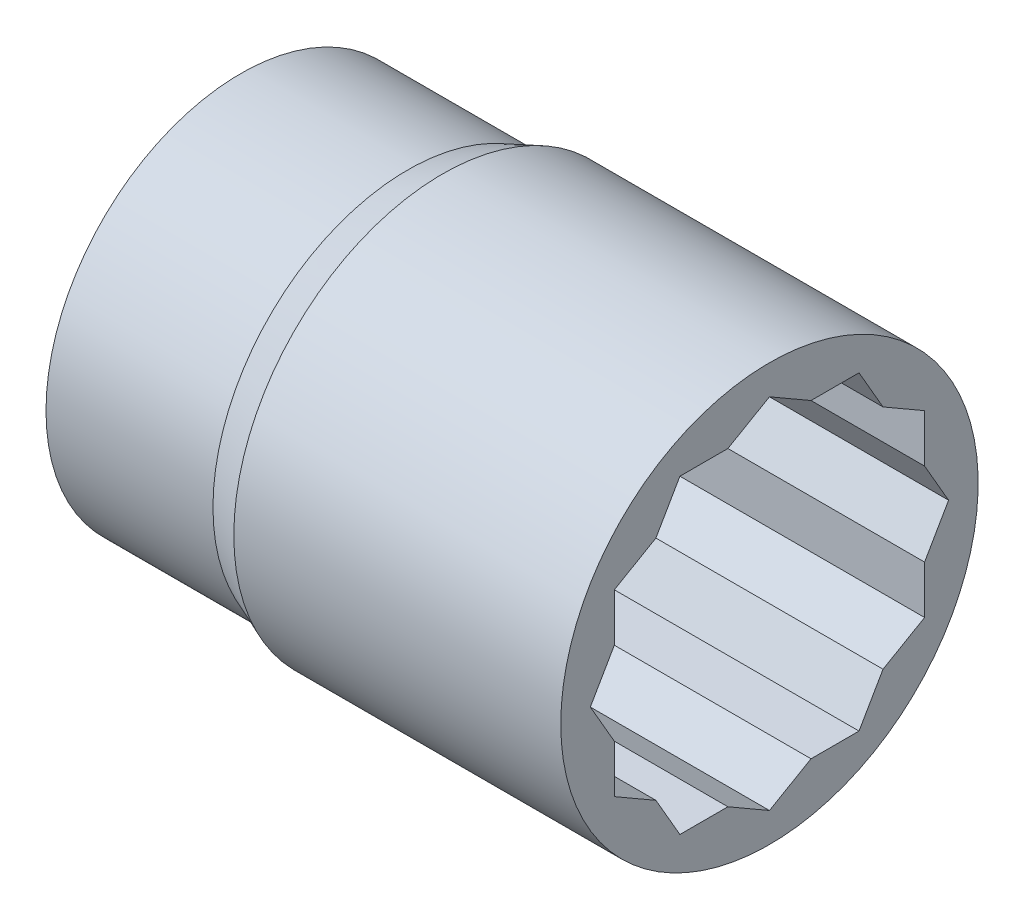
ISO-10303-21;
HEADER;
FILE_DESCRIPTION(('STEP AP214'),'2;1');
FILE_NAME('part.step','',(''),(''),'','','');
FILE_SCHEMA(('AUTOMOTIVE_DESIGN { 1 0 10303 214 1 1 1 1 }'));
ENDSEC;
DATA;
#1=APPLICATION_CONTEXT('core data for automotive mechanical design processes');
#2=APPLICATION_PROTOCOL_DEFINITION('international standard','automotive_design',2000,#1);
#3=PRODUCT_CONTEXT('',#1,'mechanical');
#4=PRODUCT('Part','Part','',(#3));
#5=PRODUCT_RELATED_PRODUCT_CATEGORY('part','',(#4));
#6=PRODUCT_DEFINITION_FORMATION('','',#4);
#7=PRODUCT_DEFINITION_CONTEXT('part definition',#1,'design');
#8=PRODUCT_DEFINITION('design','',#6,#7);
#9=PRODUCT_DEFINITION_SHAPE('','',#8);
#10=(LENGTH_UNIT() NAMED_UNIT(*) SI_UNIT(.MILLI.,.METRE.));
#11=(NAMED_UNIT(*) PLANE_ANGLE_UNIT() SI_UNIT($,.RADIAN.));
#12=(NAMED_UNIT(*) SI_UNIT($,.STERADIAN.) SOLID_ANGLE_UNIT());
#13=UNCERTAINTY_MEASURE_WITH_UNIT(LENGTH_MEASURE(1.E-05),#10,'distance_accuracy_value','');
#14=(GEOMETRIC_REPRESENTATION_CONTEXT(3) GLOBAL_UNCERTAINTY_ASSIGNED_CONTEXT((#13)) GLOBAL_UNIT_ASSIGNED_CONTEXT((#10,
#11,#12)) REPRESENTATION_CONTEXT('',''));
#15=CARTESIAN_POINT('',(0.,0.,0.));
#16=DIRECTION('',(0.,0.,1.));
#17=DIRECTION('',(1.,0.,0.));
#18=AXIS2_PLACEMENT_3D('',#15,#16,#17);
#19=CARTESIAN_POINT('',(38.,15.,0.));
#20=DIRECTION('',(-1.,0.,0.));
#21=DIRECTION('',(0.,0.,1.));
#22=AXIS2_PLACEMENT_3D('',#19,#20,#21);
#23=PLANE('',#22);
#24=DIRECTION('',(0.,-0.499999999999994,-0.866025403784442));
#25=VECTOR('',#24,1.);
#26=CARTESIAN_POINT('',(38.,-6.43745550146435,11.15));
#27=LINE('',#26,#25);
#28=CARTESIAN_POINT('',(38.,-6.43745550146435,11.15));
#29=VERTEX_POINT('',#28);
#30=CARTESIAN_POINT('',(38.,-8.16236650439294,8.16236650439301));
#31=VERTEX_POINT('',#30);
#32=EDGE_CURVE('E230',#29,#31,#27,.T.);
#33=ORIENTED_EDGE('',*,*,#32,.F.);
#34=DIRECTION('',(0.,-1.,0.));
#35=VECTOR('',#34,1.);
#36=CARTESIAN_POINT('',(38.,-2.98763349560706,11.15));
#37=LINE('',#36,#35);
#38=CARTESIAN_POINT('',(38.,-2.98763349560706,11.15));
#39=VERTEX_POINT('',#38);
#40=EDGE_CURVE('E46',#39,#29,#37,.T.);
#41=ORIENTED_EDGE('',*,*,#40,.F.);
#42=DIRECTION('',(0.,-0.866025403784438,-0.5));
#43=VECTOR('',#42,1.);
#44=CARTESIAN_POINT('',(38.,0.,12.8749110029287));
#45=LINE('',#44,#43);
#46=CARTESIAN_POINT('',(38.,0.,12.8749110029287));
#47=VERTEX_POINT('',#46);
#48=EDGE_CURVE('E299',#47,#39,#45,.T.);
#49=ORIENTED_EDGE('',*,*,#48,.F.);
#50=DIRECTION('',(0.,-0.866025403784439,0.5));
#51=VECTOR('',#50,1.);
#52=CARTESIAN_POINT('',(38.,2.98763349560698,11.15));
#53=LINE('',#52,#51);
#54=CARTESIAN_POINT('',(38.,2.98763349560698,11.15));
#55=VERTEX_POINT('',#54);
#56=EDGE_CURVE('E296',#55,#47,#53,.T.);
#57=ORIENTED_EDGE('',*,*,#56,.F.);
#58=DIRECTION('',(0.,-1.,0.));
#59=VECTOR('',#58,1.);
#60=CARTESIAN_POINT('',(38.,6.43745550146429,11.15));
#61=LINE('',#60,#59);
#62=CARTESIAN_POINT('',(38.,6.43745550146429,11.15));
#63=VERTEX_POINT('',#62);
#64=EDGE_CURVE('E293',#63,#55,#61,.T.);
#65=ORIENTED_EDGE('',*,*,#64,.F.);
#66=DIRECTION('',(0.,-0.500000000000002,0.866025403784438));
#67=VECTOR('',#66,1.);
#68=CARTESIAN_POINT('',(38.,8.16236650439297,8.16236650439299));
#69=LINE('',#68,#67);
#70=CARTESIAN_POINT('',(38.,8.16236650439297,8.16236650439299));
#71=VERTEX_POINT('',#70);
#72=EDGE_CURVE('E290',#71,#63,#69,.T.);
#73=ORIENTED_EDGE('',*,*,#72,.F.);
#74=DIRECTION('',(0.,-0.866025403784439,0.5));
#75=VECTOR('',#74,1.);
#76=CARTESIAN_POINT('',(38.,11.15,6.43745550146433));
#77=LINE('',#76,#75);
#78=CARTESIAN_POINT('',(38.,11.15,6.43745550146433));
#79=VERTEX_POINT('',#78);
#80=EDGE_CURVE('E287',#79,#71,#77,.T.);
#81=ORIENTED_EDGE('',*,*,#80,.F.);
#82=DIRECTION('',(0.,0.,1.));
#83=VECTOR('',#82,1.);
#84=CARTESIAN_POINT('',(38.,11.15,2.98763349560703));
#85=LINE('',#84,#83);
#86=CARTESIAN_POINT('',(38.,11.15,2.98763349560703));
#87=VERTEX_POINT('',#86);
#88=EDGE_CURVE('E284',#87,#79,#85,.T.);
#89=ORIENTED_EDGE('',*,*,#88,.F.);
#90=DIRECTION('',(0.,-0.500000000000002,0.866025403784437));
#91=VECTOR('',#90,1.);
#92=CARTESIAN_POINT('',(38.,12.8749110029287,0.));
#93=LINE('',#92,#91);
#94=CARTESIAN_POINT('',(38.,12.8749110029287,0.));
#95=VERTEX_POINT('',#94);
#96=EDGE_CURVE('E281',#95,#87,#93,.T.);
#97=ORIENTED_EDGE('',*,*,#96,.F.);
#98=DIRECTION('',(0.,0.5,0.866025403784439));
#99=VECTOR('',#98,1.);
#100=CARTESIAN_POINT('',(38.,11.15,-2.98763349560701));
#101=LINE('',#100,#99);
#102=CARTESIAN_POINT('',(38.,11.15,-2.98763349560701));
#103=VERTEX_POINT('',#102);
#104=EDGE_CURVE('E278',#103,#95,#101,.T.);
#105=ORIENTED_EDGE('',*,*,#104,.F.);
#106=DIRECTION('',(0.,0.,1.));
#107=VECTOR('',#106,1.);
#108=CARTESIAN_POINT('',(38.,11.15,-6.43745550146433));
#109=LINE('',#108,#107);
#110=CARTESIAN_POINT('',(38.,11.15,-6.43745550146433));
#111=VERTEX_POINT('',#110);
#112=EDGE_CURVE('E275',#111,#103,#109,.T.);
#113=ORIENTED_EDGE('',*,*,#112,.F.);
#114=DIRECTION('',(0.,0.866025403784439,0.5));
#115=VECTOR('',#114,1.);
#116=CARTESIAN_POINT('',(38.,8.16236650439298,-8.16236650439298));
#117=LINE('',#116,#115);
#118=CARTESIAN_POINT('',(38.,8.16236650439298,-8.16236650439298));
#119=VERTEX_POINT('',#118);
#120=EDGE_CURVE('E272',#119,#111,#117,.T.);
#121=ORIENTED_EDGE('',*,*,#120,.F.);
#122=DIRECTION('',(0.,0.499999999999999,0.866025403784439));
#123=VECTOR('',#122,1.);
#124=CARTESIAN_POINT('',(38.,6.43745550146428,-11.1500000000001));
#125=LINE('',#124,#123);
#126=CARTESIAN_POINT('',(38.,6.43745550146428,-11.1500000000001));
#127=VERTEX_POINT('',#126);
#128=EDGE_CURVE('E269',#127,#119,#125,.T.);
#129=ORIENTED_EDGE('',*,*,#128,.F.);
#130=DIRECTION('',(0.,1.,0.));
#131=VECTOR('',#130,1.);
#132=CARTESIAN_POINT('',(38.,2.98763349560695,-11.15));
#133=LINE('',#132,#131);
#134=CARTESIAN_POINT('',(38.,2.98763349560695,-11.15));
#135=VERTEX_POINT('',#134);
#136=EDGE_CURVE('E266',#135,#127,#133,.T.);
#137=ORIENTED_EDGE('',*,*,#136,.F.);
#138=DIRECTION('',(0.,0.866025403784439,0.5));
#139=VECTOR('',#138,1.);
#140=CARTESIAN_POINT('',(38.,0.,-12.8749110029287));
#141=LINE('',#140,#139);
#142=CARTESIAN_POINT('',(38.,0.,-12.8749110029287));
#143=VERTEX_POINT('',#142);
#144=EDGE_CURVE('E263',#143,#135,#141,.T.);
#145=ORIENTED_EDGE('',*,*,#144,.F.);
#146=DIRECTION('',(0.,0.866025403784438,-0.5));
#147=VECTOR('',#146,1.);
#148=CARTESIAN_POINT('',(38.,-2.98763349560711,-11.1499999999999));
#149=LINE('',#148,#147);
#150=CARTESIAN_POINT('',(38.,-2.98763349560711,-11.1499999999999));
#151=VERTEX_POINT('',#150);
#152=EDGE_CURVE('E260',#151,#143,#149,.T.);
#153=ORIENTED_EDGE('',*,*,#152,.F.);
#154=DIRECTION('',(0.,1.,0.));
#155=VECTOR('',#154,1.);
#156=CARTESIAN_POINT('',(38.,-6.43745550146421,-11.1499999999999));
#157=LINE('',#156,#155);
#158=CARTESIAN_POINT('',(38.,-6.43745550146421,-11.1499999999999));
#159=VERTEX_POINT('',#158);
#160=EDGE_CURVE('E257',#159,#151,#157,.T.);
#161=ORIENTED_EDGE('',*,*,#160,.F.);
#162=DIRECTION('',(0.,0.500000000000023,-0.866025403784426));
#163=VECTOR('',#162,1.);
#164=CARTESIAN_POINT('',(38.,-8.16236650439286,-8.16236650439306));
#165=LINE('',#164,#163);
#166=CARTESIAN_POINT('',(38.,-8.16236650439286,-8.16236650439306));
#167=VERTEX_POINT('',#166);
#168=EDGE_CURVE('E254',#167,#159,#165,.T.);
#169=ORIENTED_EDGE('',*,*,#168,.F.);
#170=DIRECTION('',(0.,0.866025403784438,-0.500000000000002));
#171=VECTOR('',#170,1.);
#172=CARTESIAN_POINT('',(38.,-11.15,-6.43745550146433));
#173=LINE('',#172,#171);
#174=CARTESIAN_POINT('',(38.,-11.15,-6.43745550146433));
#175=VERTEX_POINT('',#174);
#176=EDGE_CURVE('E251',#175,#167,#173,.T.);
#177=ORIENTED_EDGE('',*,*,#176,.F.);
#178=DIRECTION('',(0.,0.,-1.));
#179=VECTOR('',#178,1.);
#180=CARTESIAN_POINT('',(38.,-11.15,-2.98763349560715));
#181=LINE('',#180,#179);
#182=CARTESIAN_POINT('',(38.,-11.15,-2.98763349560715));
#183=VERTEX_POINT('',#182);
#184=EDGE_CURVE('E248',#183,#175,#181,.T.);
#185=ORIENTED_EDGE('',*,*,#184,.F.);
#186=DIRECTION('',(0.,0.500000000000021,-0.866025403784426));
#187=VECTOR('',#186,1.);
#188=CARTESIAN_POINT('',(38.,-12.8749110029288,-1.29366534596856E-13));
#189=LINE('',#188,#187);
#190=CARTESIAN_POINT('',(38.,-12.8749110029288,-1.29366534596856E-13));
#191=VERTEX_POINT('',#190);
#192=EDGE_CURVE('E245',#191,#183,#189,.T.);
#193=ORIENTED_EDGE('',*,*,#192,.F.);
#194=DIRECTION('',(0.,-0.500000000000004,-0.866025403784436));
#195=VECTOR('',#194,1.);
#196=CARTESIAN_POINT('',(38.,-11.15,2.98763349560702));
#197=LINE('',#196,#195);
#198=CARTESIAN_POINT('',(38.,-11.15,2.98763349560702));
#199=VERTEX_POINT('',#198);
#200=EDGE_CURVE('E239',#199,#191,#197,.T.);
#201=ORIENTED_EDGE('',*,*,#200,.F.);
#202=DIRECTION('',(0.,0.,-1.));
#203=VECTOR('',#202,1.);
#204=CARTESIAN_POINT('',(38.,-11.15,6.43745550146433));
#205=LINE('',#204,#203);
#206=CARTESIAN_POINT('',(38.,-11.15,6.43745550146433));
#207=VERTEX_POINT('',#206);
#208=EDGE_CURVE('E237',#207,#199,#205,.T.);
#209=ORIENTED_EDGE('',*,*,#208,.F.);
#210=DIRECTION('',(0.,-0.866025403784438,-0.5));
#211=VECTOR('',#210,1.);
#212=CARTESIAN_POINT('',(38.,-8.16236650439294,8.16236650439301));
#213=LINE('',#212,#211);
#214=EDGE_CURVE('E219',#31,#207,#213,.T.);
#215=ORIENTED_EDGE('',*,*,#214,.F.);
#216=EDGE_LOOP('',(#33,#41,#49,#57,#65,#73,#81,#89,#97,#105,#113,#121,#129,#137,#145,#153,#161,
#169,#177,#185,#193,#201,#209,#215));
#217=FACE_BOUND('',#216,.T.);
#218=CARTESIAN_POINT('',(38.,0.,0.));
#219=DIRECTION('',(-1.,0.,0.));
#220=DIRECTION('',(0.,0.,1.));
#221=AXIS2_PLACEMENT_3D('',#218,#219,#220);
#222=CIRCLE('',#221,15.);
#223=CARTESIAN_POINT('',(38.,0.,15.));
#224=VERTEX_POINT('',#223);
#225=EDGE_CURVE('E39',#224,#224,#222,.T.);
#226=ORIENTED_EDGE('',*,*,#225,.F.);
#227=EDGE_LOOP('',(#226));
#228=FACE_BOUND('',#227,.T.);
#229=ADVANCED_FACE('F32',(#217,#228),#23,.F.);
#230=CARTESIAN_POINT('',(0.,0.,0.));
#231=DIRECTION('',(-1.,0.,0.));
#232=DIRECTION('',(0.,0.,1.));
#233=AXIS2_PLACEMENT_3D('',#230,#231,#232);
#234=CYLINDRICAL_SURFACE('',#233,15.);
#235=CARTESIAN_POINT('',(14.5,0.,0.));
#236=DIRECTION('',(-1.,0.,0.));
#237=DIRECTION('',(0.,0.,1.));
#238=AXIS2_PLACEMENT_3D('',#235,#236,#237);
#239=CIRCLE('',#238,15.);
#240=CARTESIAN_POINT('',(14.5,0.,15.));
#241=VERTEX_POINT('',#240);
#242=EDGE_CURVE('E448',#241,#241,#239,.T.);
#243=ORIENTED_EDGE('',*,*,#242,.F.);
#244=EDGE_LOOP('',(#243));
#245=FACE_BOUND('',#244,.T.);
#246=ORIENTED_EDGE('',*,*,#225,.T.);
#247=EDGE_LOOP('',(#246));
#248=FACE_BOUND('',#247,.T.);
#249=ADVANCED_FACE('F453',(#245,#248),#234,.T.);
#250=CARTESIAN_POINT('',(14.5,0.,0.));
#251=DIRECTION('',(1.,0.,0.));
#252=DIRECTION('',(0.,0.,-1.));
#253=AXIS2_PLACEMENT_3D('',#250,#251,#252);
#254=CONICAL_SURFACE('',#253,15.,0.380506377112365);
#255=CARTESIAN_POINT('',(12.,0.,0.));
#256=DIRECTION('',(-1.,0.,0.));
#257=DIRECTION('',(0.,0.,1.));
#258=AXIS2_PLACEMENT_3D('',#255,#256,#257);
#259=CIRCLE('',#258,14.);
#260=CARTESIAN_POINT('',(12.,0.,14.));
#261=VERTEX_POINT('',#260);
#262=EDGE_CURVE('E445',#261,#261,#259,.T.);
#263=ORIENTED_EDGE('',*,*,#262,.F.);
#264=EDGE_LOOP('',(#263));
#265=FACE_BOUND('',#264,.T.);
#266=ORIENTED_EDGE('',*,*,#242,.T.);
#267=EDGE_LOOP('',(#266));
#268=FACE_BOUND('',#267,.T.);
#269=ADVANCED_FACE('F458',(#265,#268),#254,.T.);
#270=CARTESIAN_POINT('',(0.,0.,0.));
#271=DIRECTION('',(-1.,0.,0.));
#272=DIRECTION('',(0.,0.,1.));
#273=AXIS2_PLACEMENT_3D('',#270,#271,#272);
#274=CYLINDRICAL_SURFACE('',#273,14.);
#275=CARTESIAN_POINT('',(0.,0.,0.));
#276=DIRECTION('',(-1.,0.,0.));
#277=DIRECTION('',(0.,0.,1.));
#278=AXIS2_PLACEMENT_3D('',#275,#276,#277);
#279=CIRCLE('',#278,14.);
#280=CARTESIAN_POINT('',(0.,0.,14.));
#281=VERTEX_POINT('',#280);
#282=EDGE_CURVE('E437',#281,#281,#279,.T.);
#283=ORIENTED_EDGE('',*,*,#282,.F.);
#284=EDGE_LOOP('',(#283));
#285=FACE_BOUND('',#284,.T.);
#286=ORIENTED_EDGE('',*,*,#262,.T.);
#287=EDGE_LOOP('',(#286));
#288=FACE_BOUND('',#287,.T.);
#289=ADVANCED_FACE('F463',(#285,#288),#274,.T.);
#290=CARTESIAN_POINT('',(0.,0.,0.));
#291=DIRECTION('',(1.,0.,0.));
#292=DIRECTION('',(0.,0.,-1.));
#293=AXIS2_PLACEMENT_3D('',#290,#291,#292);
#294=PLANE('',#293);
#295=DIRECTION('',(0.,0.,1.));
#296=VECTOR('',#295,1.);
#297=CARTESIAN_POINT('',(0.,-6.,-6.));
#298=LINE('',#297,#296);
#299=CARTESIAN_POINT('',(0.,-6.,-6.));
#300=VERTEX_POINT('',#299);
#301=CARTESIAN_POINT('',(0.,-6.,6.));
#302=VERTEX_POINT('',#301);
#303=EDGE_CURVE('E425',#300,#302,#298,.T.);
#304=ORIENTED_EDGE('',*,*,#303,.F.);
#305=DIRECTION('',(0.,-1.,0.));
#306=VECTOR('',#305,1.);
#307=CARTESIAN_POINT('',(0.,6.,-6.));
#308=LINE('',#307,#306);
#309=CARTESIAN_POINT('',(0.,6.,-6.));
#310=VERTEX_POINT('',#309);
#311=EDGE_CURVE('E422',#310,#300,#308,.T.);
#312=ORIENTED_EDGE('',*,*,#311,.F.);
#313=DIRECTION('',(0.,0.,-1.));
#314=VECTOR('',#313,1.);
#315=CARTESIAN_POINT('',(0.,6.,-6.));
#316=LINE('',#315,#314);
#317=CARTESIAN_POINT('',(0.,6.,6.));
#318=VERTEX_POINT('',#317);
#319=EDGE_CURVE('E431',#318,#310,#316,.T.);
#320=ORIENTED_EDGE('',*,*,#319,.F.);
#321=DIRECTION('',(0.,1.,0.));
#322=VECTOR('',#321,1.);
#323=CARTESIAN_POINT('',(0.,6.,6.));
#324=LINE('',#323,#322);
#325=EDGE_CURVE('E428',#302,#318,#324,.T.);
#326=ORIENTED_EDGE('',*,*,#325,.F.);
#327=EDGE_LOOP('',(#304,#312,#320,#326));
#328=FACE_BOUND('',#327,.T.);
#329=ORIENTED_EDGE('',*,*,#282,.T.);
#330=EDGE_LOOP('',(#329));
#331=FACE_BOUND('',#330,.T.);
#332=ADVANCED_FACE('F470',(#328,#331),#294,.F.);
#333=CARTESIAN_POINT('',(38.,6.,-6.));
#334=DIRECTION('',(0.,0.,-1.));
#335=DIRECTION('',(0.,1.,0.));
#336=AXIS2_PLACEMENT_3D('',#333,#334,#335);
#337=PLANE('',#336);
#338=DIRECTION('',(-1.,0.,0.));
#339=VECTOR('',#338,1.);
#340=CARTESIAN_POINT('',(38.,-6.,-6.));
#341=LINE('',#340,#339);
#342=CARTESIAN_POINT('',(18.,-6.,-6.));
#343=VERTEX_POINT('',#342);
#344=EDGE_CURVE('E434',#343,#300,#341,.T.);
#345=ORIENTED_EDGE('',*,*,#344,.F.);
#346=DIRECTION('',(0.,1.,0.));
#347=VECTOR('',#346,1.);
#348=CARTESIAN_POINT('',(18.,6.,-6.));
#349=LINE('',#348,#347);
#350=CARTESIAN_POINT('',(18.,6.,-6.));
#351=VERTEX_POINT('',#350);
#352=EDGE_CURVE('E54',#343,#351,#349,.T.);
#353=ORIENTED_EDGE('',*,*,#352,.T.);
#354=DIRECTION('',(-1.,0.,0.));
#355=VECTOR('',#354,1.);
#356=CARTESIAN_POINT('',(38.,6.,-6.));
#357=LINE('',#356,#355);
#358=EDGE_CURVE('E435',#351,#310,#357,.T.);
#359=ORIENTED_EDGE('',*,*,#358,.T.);
#360=ORIENTED_EDGE('',*,*,#311,.T.);
#361=EDGE_LOOP('',(#345,#353,#359,#360));
#362=FACE_BOUND('',#361,.T.);
#363=ADVANCED_FACE('F474',(#362),#337,.F.);
#364=CARTESIAN_POINT('',(38.,6.,-6.));
#365=DIRECTION('',(0.,1.,0.));
#366=DIRECTION('',(0.,0.,1.));
#367=AXIS2_PLACEMENT_3D('',#364,#365,#366);
#368=PLANE('',#367);
#369=ORIENTED_EDGE('',*,*,#358,.F.);
#370=DIRECTION('',(0.,0.,1.));
#371=VECTOR('',#370,1.);
#372=CARTESIAN_POINT('',(18.,6.,-6.));
#373=LINE('',#372,#371);
#374=CARTESIAN_POINT('',(18.,6.,6.));
#375=VERTEX_POINT('',#374);
#376=EDGE_CURVE('E418',#351,#375,#373,.T.);
#377=ORIENTED_EDGE('',*,*,#376,.T.);
#378=DIRECTION('',(-1.,0.,0.));
#379=VECTOR('',#378,1.);
#380=CARTESIAN_POINT('',(38.,6.,6.));
#381=LINE('',#380,#379);
#382=EDGE_CURVE('E438',#375,#318,#381,.T.);
#383=ORIENTED_EDGE('',*,*,#382,.T.);
#384=ORIENTED_EDGE('',*,*,#319,.T.);
#385=EDGE_LOOP('',(#369,#377,#383,#384));
#386=FACE_BOUND('',#385,.T.);
#387=ADVANCED_FACE('F478',(#386),#368,.F.);
#388=CARTESIAN_POINT('',(38.,6.,6.));
#389=DIRECTION('',(0.,0.,1.));
#390=DIRECTION('',(0.,-1.,0.));
#391=AXIS2_PLACEMENT_3D('',#388,#389,#390);
#392=PLANE('',#391);
#393=ORIENTED_EDGE('',*,*,#382,.F.);
#394=DIRECTION('',(0.,-1.,0.));
#395=VECTOR('',#394,1.);
#396=CARTESIAN_POINT('',(18.,6.,6.));
#397=LINE('',#396,#395);
#398=CARTESIAN_POINT('',(18.,-6.,6.));
#399=VERTEX_POINT('',#398);
#400=EDGE_CURVE('E373',#375,#399,#397,.T.);
#401=ORIENTED_EDGE('',*,*,#400,.T.);
#402=DIRECTION('',(-1.,0.,0.));
#403=VECTOR('',#402,1.);
#404=CARTESIAN_POINT('',(38.,-6.,6.));
#405=LINE('',#404,#403);
#406=EDGE_CURVE('E440',#399,#302,#405,.T.);
#407=ORIENTED_EDGE('',*,*,#406,.T.);
#408=ORIENTED_EDGE('',*,*,#325,.T.);
#409=EDGE_LOOP('',(#393,#401,#407,#408));
#410=FACE_BOUND('',#409,.T.);
#411=ADVANCED_FACE('F484',(#410),#392,.F.);
#412=CARTESIAN_POINT('',(38.,-6.,-6.));
#413=DIRECTION('',(0.,-1.,0.));
#414=DIRECTION('',(0.,0.,-1.));
#415=AXIS2_PLACEMENT_3D('',#412,#413,#414);
#416=PLANE('',#415);
#417=ORIENTED_EDGE('',*,*,#406,.F.);
#418=DIRECTION('',(0.,0.,-1.));
#419=VECTOR('',#418,1.);
#420=CARTESIAN_POINT('',(18.,-6.,-6.));
#421=LINE('',#420,#419);
#422=EDGE_CURVE('E11',#399,#343,#421,.T.);
#423=ORIENTED_EDGE('',*,*,#422,.T.);
#424=ORIENTED_EDGE('',*,*,#344,.T.);
#425=ORIENTED_EDGE('',*,*,#303,.T.);
#426=EDGE_LOOP('',(#417,#423,#424,#425));
#427=FACE_BOUND('',#426,.T.);
#428=ADVANCED_FACE('F480',(#427),#416,.F.);
#429=CARTESIAN_POINT('',(18.,11.15,11.1500000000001));
#430=DIRECTION('',(-1.,0.,0.));
#431=DIRECTION('',(0.,0.,1.));
#432=AXIS2_PLACEMENT_3D('',#429,#430,#431);
#433=PLANE('',#432);
#434=DIRECTION('',(0.,-1.,0.));
#435=VECTOR('',#434,1.);
#436=CARTESIAN_POINT('',(18.,-2.98763349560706,11.15));
#437=LINE('',#436,#435);
#438=CARTESIAN_POINT('',(18.,-2.98763349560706,11.15));
#439=VERTEX_POINT('',#438);
#440=CARTESIAN_POINT('',(18.,-6.43745550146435,11.15));
#441=VERTEX_POINT('',#440);
#442=EDGE_CURVE('E302',#439,#441,#437,.T.);
#443=ORIENTED_EDGE('',*,*,#442,.T.);
#444=DIRECTION('',(0.,-0.499999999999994,-0.866025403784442));
#445=VECTOR('',#444,1.);
#446=CARTESIAN_POINT('',(18.,-6.43745550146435,11.15));
#447=LINE('',#446,#445);
#448=CARTESIAN_POINT('',(18.,-8.16236650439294,8.16236650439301));
#449=VERTEX_POINT('',#448);
#450=EDGE_CURVE('E305',#441,#449,#447,.T.);
#451=ORIENTED_EDGE('',*,*,#450,.T.);
#452=DIRECTION('',(0.,-0.866025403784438,-0.5));
#453=VECTOR('',#452,1.);
#454=CARTESIAN_POINT('',(18.,-8.16236650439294,8.16236650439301));
#455=LINE('',#454,#453);
#456=CARTESIAN_POINT('',(18.,-11.15,6.43745550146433));
#457=VERTEX_POINT('',#456);
#458=EDGE_CURVE('E222',#449,#457,#455,.T.);
#459=ORIENTED_EDGE('',*,*,#458,.T.);
#460=DIRECTION('',(0.,0.,-1.));
#461=VECTOR('',#460,1.);
#462=CARTESIAN_POINT('',(18.,-11.15,6.43745550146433));
#463=LINE('',#462,#461);
#464=CARTESIAN_POINT('',(18.,-11.15,2.98763349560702));
#465=VERTEX_POINT('',#464);
#466=EDGE_CURVE('E308',#457,#465,#463,.T.);
#467=ORIENTED_EDGE('',*,*,#466,.T.);
#468=DIRECTION('',(0.,-0.500000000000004,-0.866025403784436));
#469=VECTOR('',#468,1.);
#470=CARTESIAN_POINT('',(18.,-11.15,2.98763349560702));
#471=LINE('',#470,#469);
#472=CARTESIAN_POINT('',(18.,-12.8749110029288,-1.29366534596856E-13));
#473=VERTEX_POINT('',#472);
#474=EDGE_CURVE('E311',#465,#473,#471,.T.);
#475=ORIENTED_EDGE('',*,*,#474,.T.);
#476=DIRECTION('',(0.,0.500000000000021,-0.866025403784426));
#477=VECTOR('',#476,1.);
#478=CARTESIAN_POINT('',(18.,-12.8749110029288,-1.29366534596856E-13));
#479=LINE('',#478,#477);
#480=CARTESIAN_POINT('',(18.,-11.15,-2.98763349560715));
#481=VERTEX_POINT('',#480);
#482=EDGE_CURVE('E314',#473,#481,#479,.T.);
#483=ORIENTED_EDGE('',*,*,#482,.T.);
#484=DIRECTION('',(0.,0.,-1.));
#485=VECTOR('',#484,1.);
#486=CARTESIAN_POINT('',(18.,-11.15,-2.98763349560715));
#487=LINE('',#486,#485);
#488=CARTESIAN_POINT('',(18.,-11.15,-6.43745550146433));
#489=VERTEX_POINT('',#488);
#490=EDGE_CURVE('E317',#481,#489,#487,.T.);
#491=ORIENTED_EDGE('',*,*,#490,.T.);
#492=DIRECTION('',(0.,0.866025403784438,-0.500000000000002));
#493=VECTOR('',#492,1.);
#494=CARTESIAN_POINT('',(18.,-11.15,-6.43745550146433));
#495=LINE('',#494,#493);
#496=CARTESIAN_POINT('',(18.,-8.16236650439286,-8.16236650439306));
#497=VERTEX_POINT('',#496);
#498=EDGE_CURVE('E320',#489,#497,#495,.T.);
#499=ORIENTED_EDGE('',*,*,#498,.T.);
#500=DIRECTION('',(0.,0.500000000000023,-0.866025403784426));
#501=VECTOR('',#500,1.);
#502=CARTESIAN_POINT('',(18.,-8.16236650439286,-8.16236650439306));
#503=LINE('',#502,#501);
#504=CARTESIAN_POINT('',(18.,-6.43745550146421,-11.1499999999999));
#505=VERTEX_POINT('',#504);
#506=EDGE_CURVE('E323',#497,#505,#503,.T.);
#507=ORIENTED_EDGE('',*,*,#506,.T.);
#508=DIRECTION('',(0.,1.,0.));
#509=VECTOR('',#508,1.);
#510=CARTESIAN_POINT('',(18.,-6.43745550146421,-11.1499999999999));
#511=LINE('',#510,#509);
#512=CARTESIAN_POINT('',(18.,-2.98763349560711,-11.1499999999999));
#513=VERTEX_POINT('',#512);
#514=EDGE_CURVE('E326',#505,#513,#511,.T.);
#515=ORIENTED_EDGE('',*,*,#514,.T.);
#516=DIRECTION('',(0.,0.866025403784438,-0.5));
#517=VECTOR('',#516,1.);
#518=CARTESIAN_POINT('',(18.,-2.98763349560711,-11.1499999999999));
#519=LINE('',#518,#517);
#520=CARTESIAN_POINT('',(18.,0.,-12.8749110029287));
#521=VERTEX_POINT('',#520);
#522=EDGE_CURVE('E329',#513,#521,#519,.T.);
#523=ORIENTED_EDGE('',*,*,#522,.T.);
#524=DIRECTION('',(0.,0.866025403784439,0.5));
#525=VECTOR('',#524,1.);
#526=CARTESIAN_POINT('',(18.,0.,-12.8749110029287));
#527=LINE('',#526,#525);
#528=CARTESIAN_POINT('',(18.,2.98763349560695,-11.15));
#529=VERTEX_POINT('',#528);
#530=EDGE_CURVE('E332',#521,#529,#527,.T.);
#531=ORIENTED_EDGE('',*,*,#530,.T.);
#532=DIRECTION('',(0.,1.,0.));
#533=VECTOR('',#532,1.);
#534=CARTESIAN_POINT('',(18.,2.98763349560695,-11.15));
#535=LINE('',#534,#533);
#536=CARTESIAN_POINT('',(18.,6.43745550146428,-11.1500000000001));
#537=VERTEX_POINT('',#536);
#538=EDGE_CURVE('E335',#529,#537,#535,.T.);
#539=ORIENTED_EDGE('',*,*,#538,.T.);
#540=DIRECTION('',(0.,0.499999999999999,0.866025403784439));
#541=VECTOR('',#540,1.);
#542=CARTESIAN_POINT('',(18.,6.43745550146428,-11.1500000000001));
#543=LINE('',#542,#541);
#544=CARTESIAN_POINT('',(18.,8.16236650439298,-8.16236650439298));
#545=VERTEX_POINT('',#544);
#546=EDGE_CURVE('E338',#537,#545,#543,.T.);
#547=ORIENTED_EDGE('',*,*,#546,.T.);
#548=DIRECTION('',(0.,0.866025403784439,0.5));
#549=VECTOR('',#548,1.);
#550=CARTESIAN_POINT('',(18.,8.16236650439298,-8.16236650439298));
#551=LINE('',#550,#549);
#552=CARTESIAN_POINT('',(18.,11.15,-6.43745550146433));
#553=VERTEX_POINT('',#552);
#554=EDGE_CURVE('E341',#545,#553,#551,.T.);
#555=ORIENTED_EDGE('',*,*,#554,.T.);
#556=DIRECTION('',(0.,0.,1.));
#557=VECTOR('',#556,1.);
#558=CARTESIAN_POINT('',(18.,11.15,-6.43745550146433));
#559=LINE('',#558,#557);
#560=CARTESIAN_POINT('',(18.,11.15,-2.98763349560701));
#561=VERTEX_POINT('',#560);
#562=EDGE_CURVE('E344',#553,#561,#559,.T.);
#563=ORIENTED_EDGE('',*,*,#562,.T.);
#564=DIRECTION('',(0.,0.5,0.866025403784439));
#565=VECTOR('',#564,1.);
#566=CARTESIAN_POINT('',(18.,11.15,-2.98763349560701));
#567=LINE('',#566,#565);
#568=CARTESIAN_POINT('',(18.,12.8749110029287,0.));
#569=VERTEX_POINT('',#568);
#570=EDGE_CURVE('E347',#561,#569,#567,.T.);
#571=ORIENTED_EDGE('',*,*,#570,.T.);
#572=DIRECTION('',(0.,-0.500000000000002,0.866025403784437));
#573=VECTOR('',#572,1.);
#574=CARTESIAN_POINT('',(18.,12.8749110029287,0.));
#575=LINE('',#574,#573);
#576=CARTESIAN_POINT('',(18.,11.15,2.98763349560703));
#577=VERTEX_POINT('',#576);
#578=EDGE_CURVE('E350',#569,#577,#575,.T.);
#579=ORIENTED_EDGE('',*,*,#578,.T.);
#580=DIRECTION('',(0.,0.,1.));
#581=VECTOR('',#580,1.);
#582=CARTESIAN_POINT('',(18.,11.15,2.98763349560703));
#583=LINE('',#582,#581);
#584=CARTESIAN_POINT('',(18.,11.15,6.43745550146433));
#585=VERTEX_POINT('',#584);
#586=EDGE_CURVE('E353',#577,#585,#583,.T.);
#587=ORIENTED_EDGE('',*,*,#586,.T.);
#588=DIRECTION('',(0.,-0.866025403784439,0.5));
#589=VECTOR('',#588,1.);
#590=CARTESIAN_POINT('',(18.,11.15,6.43745550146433));
#591=LINE('',#590,#589);
#592=CARTESIAN_POINT('',(18.,8.16236650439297,8.16236650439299));
#593=VERTEX_POINT('',#592);
#594=EDGE_CURVE('E356',#585,#593,#591,.T.);
#595=ORIENTED_EDGE('',*,*,#594,.T.);
#596=DIRECTION('',(0.,-0.500000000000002,0.866025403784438));
#597=VECTOR('',#596,1.);
#598=CARTESIAN_POINT('',(18.,8.16236650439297,8.16236650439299));
#599=LINE('',#598,#597);
#600=CARTESIAN_POINT('',(18.,6.43745550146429,11.15));
#601=VERTEX_POINT('',#600);
#602=EDGE_CURVE('E359',#593,#601,#599,.T.);
#603=ORIENTED_EDGE('',*,*,#602,.T.);
#604=DIRECTION('',(0.,-1.,0.));
#605=VECTOR('',#604,1.);
#606=CARTESIAN_POINT('',(18.,6.43745550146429,11.15));
#607=LINE('',#606,#605);
#608=CARTESIAN_POINT('',(18.,2.98763349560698,11.15));
#609=VERTEX_POINT('',#608);
#610=EDGE_CURVE('E362',#601,#609,#607,.T.);
#611=ORIENTED_EDGE('',*,*,#610,.T.);
#612=DIRECTION('',(0.,-0.866025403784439,0.5));
#613=VECTOR('',#612,1.);
#614=CARTESIAN_POINT('',(18.,2.98763349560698,11.15));
#615=LINE('',#614,#613);
#616=CARTESIAN_POINT('',(18.,0.,12.8749110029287));
#617=VERTEX_POINT('',#616);
#618=EDGE_CURVE('E365',#609,#617,#615,.T.);
#619=ORIENTED_EDGE('',*,*,#618,.T.);
#620=DIRECTION('',(0.,-0.866025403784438,-0.5));
#621=VECTOR('',#620,1.);
#622=CARTESIAN_POINT('',(18.,0.,12.8749110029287));
#623=LINE('',#622,#621);
#624=EDGE_CURVE('E368',#617,#439,#623,.T.);
#625=ORIENTED_EDGE('',*,*,#624,.T.);
#626=EDGE_LOOP('',(#443,#451,#459,#467,#475,#483,#491,#499,#507,#515,#523,#531,#539,#547,#555,
#563,#571,#579,#587,#595,#603,#611,#619,#625));
#627=FACE_BOUND('',#626,.T.);
#628=ORIENTED_EDGE('',*,*,#422,.F.);
#629=ORIENTED_EDGE('',*,*,#400,.F.);
#630=ORIENTED_EDGE('',*,*,#376,.F.);
#631=ORIENTED_EDGE('',*,*,#352,.F.);
#632=EDGE_LOOP('',(#628,#629,#630,#631));
#633=FACE_BOUND('',#632,.T.);
#634=ADVANCED_FACE('F483',(#627,#633),#433,.F.);
#635=CARTESIAN_POINT('',(18.,-2.98763349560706,11.15));
#636=DIRECTION('',(0.,0.,1.));
#637=DIRECTION('',(0.,-1.,0.));
#638=AXIS2_PLACEMENT_3D('',#635,#636,#637);
#639=PLANE('',#638);
#640=ORIENTED_EDGE('',*,*,#40,.T.);
#641=DIRECTION('',(1.,0.,0.));
#642=VECTOR('',#641,1.);
#643=CARTESIAN_POINT('',(18.,-6.43745550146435,11.15));
#644=LINE('',#643,#642);
#645=EDGE_CURVE('E227',#441,#29,#644,.T.);
#646=ORIENTED_EDGE('',*,*,#645,.F.);
#647=ORIENTED_EDGE('',*,*,#442,.F.);
#648=DIRECTION('',(1.,0.,0.));
#649=VECTOR('',#648,1.);
#650=CARTESIAN_POINT('',(18.,-2.98763349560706,11.15));
#651=LINE('',#650,#649);
#652=EDGE_CURVE('E371',#439,#39,#651,.T.);
#653=ORIENTED_EDGE('',*,*,#652,.T.);
#654=EDGE_LOOP('',(#640,#646,#647,#653));
#655=FACE_BOUND('',#654,.T.);
#656=ADVANCED_FACE('F492',(#655),#639,.F.);
#657=CARTESIAN_POINT('',(18.,0.,12.8749110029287));
#658=DIRECTION('',(0.,-0.5,0.866025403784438));
#659=DIRECTION('',(0.,-0.866025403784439,-0.5));
#660=AXIS2_PLACEMENT_3D('',#657,#658,#659);
#661=PLANE('',#660);
#662=ORIENTED_EDGE('',*,*,#48,.T.);
#663=ORIENTED_EDGE('',*,*,#652,.F.);
#664=ORIENTED_EDGE('',*,*,#624,.F.);
#665=DIRECTION('',(1.,0.,0.));
#666=VECTOR('',#665,1.);
#667=CARTESIAN_POINT('',(18.,0.,12.8749110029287));
#668=LINE('',#667,#666);
#669=EDGE_CURVE('E374',#617,#47,#668,.T.);
#670=ORIENTED_EDGE('',*,*,#669,.T.);
#671=EDGE_LOOP('',(#662,#663,#664,#670));
#672=FACE_BOUND('',#671,.T.);
#673=ADVANCED_FACE('F495',(#672),#661,.F.);
#674=CARTESIAN_POINT('',(18.,2.98763349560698,11.15));
#675=DIRECTION('',(0.,0.5,0.866025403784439));
#676=DIRECTION('',(0.,-0.866025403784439,0.5));
#677=AXIS2_PLACEMENT_3D('',#674,#675,#676);
#678=PLANE('',#677);
#679=ORIENTED_EDGE('',*,*,#56,.T.);
#680=ORIENTED_EDGE('',*,*,#669,.F.);
#681=ORIENTED_EDGE('',*,*,#618,.F.);
#682=DIRECTION('',(1.,0.,0.));
#683=VECTOR('',#682,1.);
#684=CARTESIAN_POINT('',(18.,2.98763349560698,11.15));
#685=LINE('',#684,#683);
#686=EDGE_CURVE('E376',#609,#55,#685,.T.);
#687=ORIENTED_EDGE('',*,*,#686,.T.);
#688=EDGE_LOOP('',(#679,#680,#681,#687));
#689=FACE_BOUND('',#688,.T.);
#690=ADVANCED_FACE('F575',(#689),#678,.F.);
#691=CARTESIAN_POINT('',(18.,6.43745550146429,11.15));
#692=DIRECTION('',(0.,0.,1.));
#693=DIRECTION('',(0.,-1.,0.));
#694=AXIS2_PLACEMENT_3D('',#691,#692,#693);
#695=PLANE('',#694);
#696=ORIENTED_EDGE('',*,*,#64,.T.);
#697=ORIENTED_EDGE('',*,*,#686,.F.);
#698=ORIENTED_EDGE('',*,*,#610,.F.);
#699=DIRECTION('',(1.,0.,0.));
#700=VECTOR('',#699,1.);
#701=CARTESIAN_POINT('',(18.,6.43745550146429,11.15));
#702=LINE('',#701,#700);
#703=EDGE_CURVE('E378',#601,#63,#702,.T.);
#704=ORIENTED_EDGE('',*,*,#703,.T.);
#705=EDGE_LOOP('',(#696,#697,#698,#704));
#706=FACE_BOUND('',#705,.T.);
#707=ADVANCED_FACE('F571',(#706),#695,.F.);
#708=CARTESIAN_POINT('',(18.,8.16236650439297,8.16236650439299));
#709=DIRECTION('',(0.,0.866025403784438,0.500000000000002));
#710=DIRECTION('',(0.,-0.500000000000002,0.866025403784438));
#711=AXIS2_PLACEMENT_3D('',#708,#709,#710);
#712=PLANE('',#711);
#713=ORIENTED_EDGE('',*,*,#72,.T.);
#714=ORIENTED_EDGE('',*,*,#703,.F.);
#715=ORIENTED_EDGE('',*,*,#602,.F.);
#716=DIRECTION('',(1.,0.,0.));
#717=VECTOR('',#716,1.);
#718=CARTESIAN_POINT('',(18.,8.16236650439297,8.16236650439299));
#719=LINE('',#718,#717);
#720=EDGE_CURVE('E380',#593,#71,#719,.T.);
#721=ORIENTED_EDGE('',*,*,#720,.T.);
#722=EDGE_LOOP('',(#713,#714,#715,#721));
#723=FACE_BOUND('',#722,.T.);
#724=ADVANCED_FACE('F567',(#723),#712,.F.);
#725=CARTESIAN_POINT('',(18.,11.15,6.43745550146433));
#726=DIRECTION('',(0.,0.5,0.866025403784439));
#727=DIRECTION('',(0.,-0.866025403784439,0.5));
#728=AXIS2_PLACEMENT_3D('',#725,#726,#727);
#729=PLANE('',#728);
#730=ORIENTED_EDGE('',*,*,#80,.T.);
#731=ORIENTED_EDGE('',*,*,#720,.F.);
#732=ORIENTED_EDGE('',*,*,#594,.F.);
#733=DIRECTION('',(1.,0.,0.));
#734=VECTOR('',#733,1.);
#735=CARTESIAN_POINT('',(18.,11.15,6.43745550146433));
#736=LINE('',#735,#734);
#737=EDGE_CURVE('E382',#585,#79,#736,.T.);
#738=ORIENTED_EDGE('',*,*,#737,.T.);
#739=EDGE_LOOP('',(#730,#731,#732,#738));
#740=FACE_BOUND('',#739,.T.);
#741=ADVANCED_FACE('F563',(#740),#729,.F.);
#742=CARTESIAN_POINT('',(18.,11.15,2.98763349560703));
#743=DIRECTION('',(0.,1.,0.));
#744=DIRECTION('',(0.,0.,1.));
#745=AXIS2_PLACEMENT_3D('',#742,#743,#744);
#746=PLANE('',#745);
#747=ORIENTED_EDGE('',*,*,#88,.T.);
#748=ORIENTED_EDGE('',*,*,#737,.F.);
#749=ORIENTED_EDGE('',*,*,#586,.F.);
#750=DIRECTION('',(1.,0.,0.));
#751=VECTOR('',#750,1.);
#752=CARTESIAN_POINT('',(18.,11.15,2.98763349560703));
#753=LINE('',#752,#751);
#754=EDGE_CURVE('E384',#577,#87,#753,.T.);
#755=ORIENTED_EDGE('',*,*,#754,.T.);
#756=EDGE_LOOP('',(#747,#748,#749,#755));
#757=FACE_BOUND('',#756,.T.);
#758=ADVANCED_FACE('F559',(#757),#746,.F.);
#759=CARTESIAN_POINT('',(18.,12.8749110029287,0.));
#760=DIRECTION('',(0.,0.866025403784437,0.500000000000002));
#761=DIRECTION('',(0.,-0.500000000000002,0.866025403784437));
#762=AXIS2_PLACEMENT_3D('',#759,#760,#761);
#763=PLANE('',#762);
#764=ORIENTED_EDGE('',*,*,#96,.T.);
#765=ORIENTED_EDGE('',*,*,#754,.F.);
#766=ORIENTED_EDGE('',*,*,#578,.F.);
#767=DIRECTION('',(1.,0.,0.));
#768=VECTOR('',#767,1.);
#769=CARTESIAN_POINT('',(18.,12.8749110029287,0.));
#770=LINE('',#769,#768);
#771=EDGE_CURVE('E386',#569,#95,#770,.T.);
#772=ORIENTED_EDGE('',*,*,#771,.T.);
#773=EDGE_LOOP('',(#764,#765,#766,#772));
#774=FACE_BOUND('',#773,.T.);
#775=ADVANCED_FACE('F555',(#774),#763,.F.);
#776=CARTESIAN_POINT('',(18.,11.15,-2.98763349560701));
#777=DIRECTION('',(0.,0.866025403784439,-0.5));
#778=DIRECTION('',(0.,0.5,0.866025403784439));
#779=AXIS2_PLACEMENT_3D('',#776,#777,#778);
#780=PLANE('',#779);
#781=ORIENTED_EDGE('',*,*,#104,.T.);
#782=ORIENTED_EDGE('',*,*,#771,.F.);
#783=ORIENTED_EDGE('',*,*,#570,.F.);
#784=DIRECTION('',(1.,0.,0.));
#785=VECTOR('',#784,1.);
#786=CARTESIAN_POINT('',(18.,11.15,-2.98763349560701));
#787=LINE('',#786,#785);
#788=EDGE_CURVE('E388',#561,#103,#787,.T.);
#789=ORIENTED_EDGE('',*,*,#788,.T.);
#790=EDGE_LOOP('',(#781,#782,#783,#789));
#791=FACE_BOUND('',#790,.T.);
#792=ADVANCED_FACE('F551',(#791),#780,.F.);
#793=CARTESIAN_POINT('',(18.,11.15,-6.43745550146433));
#794=DIRECTION('',(0.,1.,0.));
#795=DIRECTION('',(0.,0.,1.));
#796=AXIS2_PLACEMENT_3D('',#793,#794,#795);
#797=PLANE('',#796);
#798=ORIENTED_EDGE('',*,*,#112,.T.);
#799=ORIENTED_EDGE('',*,*,#788,.F.);
#800=ORIENTED_EDGE('',*,*,#562,.F.);
#801=DIRECTION('',(1.,0.,0.));
#802=VECTOR('',#801,1.);
#803=CARTESIAN_POINT('',(18.,11.15,-6.43745550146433));
#804=LINE('',#803,#802);
#805=EDGE_CURVE('E390',#553,#111,#804,.T.);
#806=ORIENTED_EDGE('',*,*,#805,.T.);
#807=EDGE_LOOP('',(#798,#799,#800,#806));
#808=FACE_BOUND('',#807,.T.);
#809=ADVANCED_FACE('F547',(#808),#797,.F.);
#810=CARTESIAN_POINT('',(18.,8.16236650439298,-8.16236650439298));
#811=DIRECTION('',(0.,0.5,-0.866025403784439));
#812=DIRECTION('',(0.,0.866025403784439,0.5));
#813=AXIS2_PLACEMENT_3D('',#810,#811,#812);
#814=PLANE('',#813);
#815=ORIENTED_EDGE('',*,*,#120,.T.);
#816=ORIENTED_EDGE('',*,*,#805,.F.);
#817=ORIENTED_EDGE('',*,*,#554,.F.);
#818=DIRECTION('',(1.,0.,0.));
#819=VECTOR('',#818,1.);
#820=CARTESIAN_POINT('',(18.,8.16236650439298,-8.16236650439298));
#821=LINE('',#820,#819);
#822=EDGE_CURVE('E392',#545,#119,#821,.T.);
#823=ORIENTED_EDGE('',*,*,#822,.T.);
#824=EDGE_LOOP('',(#815,#816,#817,#823));
#825=FACE_BOUND('',#824,.T.);
#826=ADVANCED_FACE('F543',(#825),#814,.F.);
#827=CARTESIAN_POINT('',(18.,6.43745550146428,-11.1500000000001));
#828=DIRECTION('',(0.,0.866025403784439,-0.499999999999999));
#829=DIRECTION('',(0.,0.499999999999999,0.866025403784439));
#830=AXIS2_PLACEMENT_3D('',#827,#828,#829);
#831=PLANE('',#830);
#832=ORIENTED_EDGE('',*,*,#128,.T.);
#833=ORIENTED_EDGE('',*,*,#822,.F.);
#834=ORIENTED_EDGE('',*,*,#546,.F.);
#835=DIRECTION('',(1.,0.,0.));
#836=VECTOR('',#835,1.);
#837=CARTESIAN_POINT('',(18.,6.43745550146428,-11.1500000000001));
#838=LINE('',#837,#836);
#839=EDGE_CURVE('E394',#537,#127,#838,.T.);
#840=ORIENTED_EDGE('',*,*,#839,.T.);
#841=EDGE_LOOP('',(#832,#833,#834,#840));
#842=FACE_BOUND('',#841,.T.);
#843=ADVANCED_FACE('F539',(#842),#831,.F.);
#844=CARTESIAN_POINT('',(18.,2.98763349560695,-11.15));
#845=DIRECTION('',(0.,0.,-1.));
#846=DIRECTION('',(0.,1.,0.));
#847=AXIS2_PLACEMENT_3D('',#844,#845,#846);
#848=PLANE('',#847);
#849=ORIENTED_EDGE('',*,*,#136,.T.);
#850=ORIENTED_EDGE('',*,*,#839,.F.);
#851=ORIENTED_EDGE('',*,*,#538,.F.);
#852=DIRECTION('',(1.,0.,0.));
#853=VECTOR('',#852,1.);
#854=CARTESIAN_POINT('',(18.,2.98763349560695,-11.15));
#855=LINE('',#854,#853);
#856=EDGE_CURVE('E396',#529,#135,#855,.T.);
#857=ORIENTED_EDGE('',*,*,#856,.T.);
#858=EDGE_LOOP('',(#849,#850,#851,#857));
#859=FACE_BOUND('',#858,.T.);
#860=ADVANCED_FACE('F535',(#859),#848,.F.);
#861=CARTESIAN_POINT('',(18.,0.,-12.8749110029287));
#862=DIRECTION('',(0.,0.5,-0.866025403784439));
#863=DIRECTION('',(0.,0.866025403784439,0.5));
#864=AXIS2_PLACEMENT_3D('',#861,#862,#863);
#865=PLANE('',#864);
#866=ORIENTED_EDGE('',*,*,#144,.T.);
#867=ORIENTED_EDGE('',*,*,#856,.F.);
#868=ORIENTED_EDGE('',*,*,#530,.F.);
#869=DIRECTION('',(1.,0.,0.));
#870=VECTOR('',#869,1.);
#871=CARTESIAN_POINT('',(18.,0.,-12.8749110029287));
#872=LINE('',#871,#870);
#873=EDGE_CURVE('E398',#521,#143,#872,.T.);
#874=ORIENTED_EDGE('',*,*,#873,.T.);
#875=EDGE_LOOP('',(#866,#867,#868,#874));
#876=FACE_BOUND('',#875,.T.);
#877=ADVANCED_FACE('F531',(#876),#865,.F.);
#878=CARTESIAN_POINT('',(18.,-2.98763349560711,-11.1499999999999));
#879=DIRECTION('',(0.,-0.5,-0.866025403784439));
#880=DIRECTION('',(0.,0.866025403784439,-0.5));
#881=AXIS2_PLACEMENT_3D('',#878,#879,#880);
#882=PLANE('',#881);
#883=ORIENTED_EDGE('',*,*,#152,.T.);
#884=ORIENTED_EDGE('',*,*,#873,.F.);
#885=ORIENTED_EDGE('',*,*,#522,.F.);
#886=DIRECTION('',(1.,0.,0.));
#887=VECTOR('',#886,1.);
#888=CARTESIAN_POINT('',(18.,-2.98763349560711,-11.1499999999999));
#889=LINE('',#888,#887);
#890=EDGE_CURVE('E400',#513,#151,#889,.T.);
#891=ORIENTED_EDGE('',*,*,#890,.T.);
#892=EDGE_LOOP('',(#883,#884,#885,#891));
#893=FACE_BOUND('',#892,.T.);
#894=ADVANCED_FACE('F527',(#893),#882,.F.);
#895=CARTESIAN_POINT('',(18.,-6.43745550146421,-11.1499999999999));
#896=DIRECTION('',(0.,0.,-1.));
#897=DIRECTION('',(0.,1.,0.));
#898=AXIS2_PLACEMENT_3D('',#895,#896,#897);
#899=PLANE('',#898);
#900=ORIENTED_EDGE('',*,*,#160,.T.);
#901=ORIENTED_EDGE('',*,*,#890,.F.);
#902=ORIENTED_EDGE('',*,*,#514,.F.);
#903=DIRECTION('',(1.,0.,0.));
#904=VECTOR('',#903,1.);
#905=CARTESIAN_POINT('',(18.,-6.43745550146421,-11.1499999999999));
#906=LINE('',#905,#904);
#907=EDGE_CURVE('E402',#505,#159,#906,.T.);
#908=ORIENTED_EDGE('',*,*,#907,.T.);
#909=EDGE_LOOP('',(#900,#901,#902,#908));
#910=FACE_BOUND('',#909,.T.);
#911=ADVANCED_FACE('F523',(#910),#899,.F.);
#912=CARTESIAN_POINT('',(18.,-8.16236650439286,-8.16236650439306));
#913=DIRECTION('',(0.,-0.866025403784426,-0.500000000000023));
#914=DIRECTION('',(0.,0.500000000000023,-0.866025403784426));
#915=AXIS2_PLACEMENT_3D('',#912,#913,#914);
#916=PLANE('',#915);
#917=ORIENTED_EDGE('',*,*,#168,.T.);
#918=ORIENTED_EDGE('',*,*,#907,.F.);
#919=ORIENTED_EDGE('',*,*,#506,.F.);
#920=DIRECTION('',(1.,0.,0.));
#921=VECTOR('',#920,1.);
#922=CARTESIAN_POINT('',(18.,-8.16236650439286,-8.16236650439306));
#923=LINE('',#922,#921);
#924=EDGE_CURVE('E404',#497,#167,#923,.T.);
#925=ORIENTED_EDGE('',*,*,#924,.T.);
#926=EDGE_LOOP('',(#917,#918,#919,#925));
#927=FACE_BOUND('',#926,.T.);
#928=ADVANCED_FACE('F519',(#927),#916,.F.);
#929=CARTESIAN_POINT('',(18.,-11.15,-6.43745550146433));
#930=DIRECTION('',(0.,-0.500000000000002,-0.866025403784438));
#931=DIRECTION('',(0.,0.866025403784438,-0.500000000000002));
#932=AXIS2_PLACEMENT_3D('',#929,#930,#931);
#933=PLANE('',#932);
#934=ORIENTED_EDGE('',*,*,#176,.T.);
#935=ORIENTED_EDGE('',*,*,#924,.F.);
#936=ORIENTED_EDGE('',*,*,#498,.F.);
#937=DIRECTION('',(1.,0.,0.));
#938=VECTOR('',#937,1.);
#939=CARTESIAN_POINT('',(18.,-11.15,-6.43745550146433));
#940=LINE('',#939,#938);
#941=EDGE_CURVE('E406',#489,#175,#940,.T.);
#942=ORIENTED_EDGE('',*,*,#941,.T.);
#943=EDGE_LOOP('',(#934,#935,#936,#942));
#944=FACE_BOUND('',#943,.T.);
#945=ADVANCED_FACE('F515',(#944),#933,.F.);
#946=CARTESIAN_POINT('',(18.,-11.15,-2.98763349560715));
#947=DIRECTION('',(0.,-1.,0.));
#948=DIRECTION('',(0.,0.,-1.));
#949=AXIS2_PLACEMENT_3D('',#946,#947,#948);
#950=PLANE('',#949);
#951=ORIENTED_EDGE('',*,*,#184,.T.);
#952=ORIENTED_EDGE('',*,*,#941,.F.);
#953=ORIENTED_EDGE('',*,*,#490,.F.);
#954=DIRECTION('',(1.,0.,0.));
#955=VECTOR('',#954,1.);
#956=CARTESIAN_POINT('',(18.,-11.15,-2.98763349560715));
#957=LINE('',#956,#955);
#958=EDGE_CURVE('E408',#481,#183,#957,.T.);
#959=ORIENTED_EDGE('',*,*,#958,.T.);
#960=EDGE_LOOP('',(#951,#952,#953,#959));
#961=FACE_BOUND('',#960,.T.);
#962=ADVANCED_FACE('F511',(#961),#950,.F.);
#963=CARTESIAN_POINT('',(18.,-12.8749110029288,-1.29366534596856E-13));
#964=DIRECTION('',(0.,-0.866025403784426,-0.500000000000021));
#965=DIRECTION('',(0.,0.500000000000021,-0.866025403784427));
#966=AXIS2_PLACEMENT_3D('',#963,#964,#965);
#967=PLANE('',#966);
#968=ORIENTED_EDGE('',*,*,#192,.T.);
#969=ORIENTED_EDGE('',*,*,#958,.F.);
#970=ORIENTED_EDGE('',*,*,#482,.F.);
#971=DIRECTION('',(1.,0.,0.));
#972=VECTOR('',#971,1.);
#973=CARTESIAN_POINT('',(18.,-12.8749110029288,-1.29366534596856E-13));
#974=LINE('',#973,#972);
#975=EDGE_CURVE('E410',#473,#191,#974,.T.);
#976=ORIENTED_EDGE('',*,*,#975,.T.);
#977=EDGE_LOOP('',(#968,#969,#970,#976));
#978=FACE_BOUND('',#977,.T.);
#979=ADVANCED_FACE('F507',(#978),#967,.F.);
#980=CARTESIAN_POINT('',(18.,-11.15,2.98763349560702));
#981=DIRECTION('',(0.,-0.866025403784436,0.500000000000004));
#982=DIRECTION('',(0.,-0.500000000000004,-0.866025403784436));
#983=AXIS2_PLACEMENT_3D('',#980,#981,#982);
#984=PLANE('',#983);
#985=ORIENTED_EDGE('',*,*,#200,.T.);
#986=ORIENTED_EDGE('',*,*,#975,.F.);
#987=ORIENTED_EDGE('',*,*,#474,.F.);
#988=DIRECTION('',(1.,0.,0.));
#989=VECTOR('',#988,1.);
#990=CARTESIAN_POINT('',(18.,-11.15,2.98763349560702));
#991=LINE('',#990,#989);
#992=EDGE_CURVE('E412',#465,#199,#991,.T.);
#993=ORIENTED_EDGE('',*,*,#992,.T.);
#994=EDGE_LOOP('',(#985,#986,#987,#993));
#995=FACE_BOUND('',#994,.T.);
#996=ADVANCED_FACE('F503',(#995),#984,.F.);
#997=CARTESIAN_POINT('',(18.,-11.15,6.43745550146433));
#998=DIRECTION('',(0.,-1.,0.));
#999=DIRECTION('',(0.,0.,-1.));
#1000=AXIS2_PLACEMENT_3D('',#997,#998,#999);
#1001=PLANE('',#1000);
#1002=ORIENTED_EDGE('',*,*,#208,.T.);
#1003=ORIENTED_EDGE('',*,*,#992,.F.);
#1004=ORIENTED_EDGE('',*,*,#466,.F.);
#1005=DIRECTION('',(1.,0.,0.));
#1006=VECTOR('',#1005,1.);
#1007=CARTESIAN_POINT('',(18.,-11.15,6.43745550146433));
#1008=LINE('',#1007,#1006);
#1009=EDGE_CURVE('E226',#457,#207,#1008,.T.);
#1010=ORIENTED_EDGE('',*,*,#1009,.T.);
#1011=EDGE_LOOP('',(#1002,#1003,#1004,#1010));
#1012=FACE_BOUND('',#1011,.T.);
#1013=ADVANCED_FACE('F500',(#1012),#1001,.F.);
#1014=CARTESIAN_POINT('',(18.,-8.16236650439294,8.16236650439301));
#1015=DIRECTION('',(0.,-0.5,0.866025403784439));
#1016=DIRECTION('',(0.,-0.866025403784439,-0.5));
#1017=AXIS2_PLACEMENT_3D('',#1014,#1015,#1016);
#1018=PLANE('',#1017);
#1019=ORIENTED_EDGE('',*,*,#214,.T.);
#1020=ORIENTED_EDGE('',*,*,#1009,.F.);
#1021=ORIENTED_EDGE('',*,*,#458,.F.);
#1022=DIRECTION('',(1.,0.,0.));
#1023=VECTOR('',#1022,1.);
#1024=CARTESIAN_POINT('',(18.,-8.16236650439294,8.16236650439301));
#1025=LINE('',#1024,#1023);
#1026=EDGE_CURVE('E215',#449,#31,#1025,.T.);
#1027=ORIENTED_EDGE('',*,*,#1026,.T.);
#1028=EDGE_LOOP('',(#1019,#1020,#1021,#1027));
#1029=FACE_BOUND('',#1028,.T.);
#1030=ADVANCED_FACE('F217',(#1029),#1018,.F.);
#1031=CARTESIAN_POINT('',(18.,-6.43745550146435,11.15));
#1032=DIRECTION('',(0.,-0.866025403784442,0.499999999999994));
#1033=DIRECTION('',(0.,-0.499999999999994,-0.866025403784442));
#1034=AXIS2_PLACEMENT_3D('',#1031,#1032,#1033);
#1035=PLANE('',#1034);
#1036=ORIENTED_EDGE('',*,*,#32,.T.);
#1037=ORIENTED_EDGE('',*,*,#1026,.F.);
#1038=ORIENTED_EDGE('',*,*,#450,.F.);
#1039=ORIENTED_EDGE('',*,*,#645,.T.);
#1040=EDGE_LOOP('',(#1036,#1037,#1038,#1039));
#1041=FACE_BOUND('',#1040,.T.);
#1042=ADVANCED_FACE('F231',(#1041),#1035,.F.);
#1043=CLOSED_SHELL('',(#229,#249,#269,#289,#332,#363,#387,#411,#428,#634,#656,#673,#690,#707,
#724,#741,#758,#775,#792,#809,#826,#843,#860,#877,#894,#911,#928,#945,#962,#979,#996,#1013,
#1030,#1042));
#1044=MANIFOLD_SOLID_BREP('B2',#1043);
#1045=ADVANCED_BREP_SHAPE_REPRESENTATION('',(#18,#1044),#14);
#1046=SHAPE_DEFINITION_REPRESENTATION(#9,#1045);
ENDSEC;
END-ISO-10303-21;
